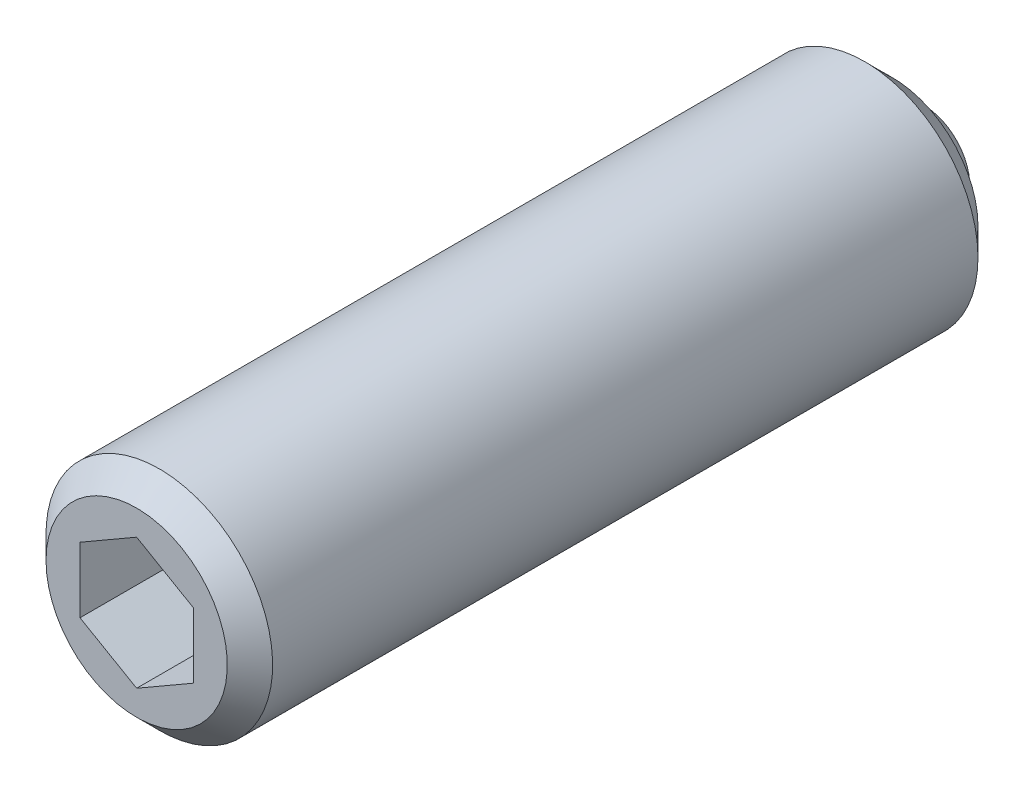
ISO-10303-21;
HEADER;
FILE_DESCRIPTION(('STEP AP214'),'2;1');
FILE_NAME('part.step','',(''),(''),'','','');
FILE_SCHEMA(('AUTOMOTIVE_DESIGN { 1 0 10303 214 1 1 1 1 }'));
ENDSEC;
DATA;
#1=APPLICATION_CONTEXT('core data for automotive mechanical design processes');
#2=APPLICATION_PROTOCOL_DEFINITION('international standard','automotive_design',2000,#1);
#3=PRODUCT_CONTEXT('',#1,'mechanical');
#4=PRODUCT('Part','Part','',(#3));
#5=PRODUCT_RELATED_PRODUCT_CATEGORY('part','',(#4));
#6=PRODUCT_DEFINITION_FORMATION('','',#4);
#7=PRODUCT_DEFINITION_CONTEXT('part definition',#1,'design');
#8=PRODUCT_DEFINITION('design','',#6,#7);
#9=PRODUCT_DEFINITION_SHAPE('','',#8);
#10=(LENGTH_UNIT() NAMED_UNIT(*) SI_UNIT(.MILLI.,.METRE.));
#11=(NAMED_UNIT(*) PLANE_ANGLE_UNIT() SI_UNIT($,.RADIAN.));
#12=(NAMED_UNIT(*) SI_UNIT($,.STERADIAN.) SOLID_ANGLE_UNIT());
#13=UNCERTAINTY_MEASURE_WITH_UNIT(LENGTH_MEASURE(1.E-05),#10,'distance_accuracy_value','');
#14=(GEOMETRIC_REPRESENTATION_CONTEXT(3) GLOBAL_UNCERTAINTY_ASSIGNED_CONTEXT((#13)) GLOBAL_UNIT_ASSIGNED_CONTEXT((#10,
#11,#12)) REPRESENTATION_CONTEXT('',''));
#15=CARTESIAN_POINT('',(0.,0.,0.));
#16=DIRECTION('',(0.,0.,1.));
#17=DIRECTION('',(1.,0.,0.));
#18=AXIS2_PLACEMENT_3D('',#15,#16,#17);
#19=CARTESIAN_POINT('',(-7.77251369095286E-10,1.26264430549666E-13,17.95));
#20=DIRECTION('',(-4.33009119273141E-11,0.,1.));
#21=DIRECTION('',(-0.499999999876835,0.866025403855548,-2.16565477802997E-11));
#22=AXIS2_PLACEMENT_3D('',#19,#20,#21);
#23=CYLINDRICAL_SURFACE('',#22,6.);
#24=CARTESIAN_POINT('',(-1.78832766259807E-09,2.90513703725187E-13,41.3));
#25=DIRECTION('',(-4.33009119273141E-11,0.,1.));
#26=DIRECTION('',(-0.499999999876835,0.866025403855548,-2.16565839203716E-11));
#27=AXIS2_PLACEMENT_3D('',#24,#25,#26);
#28=CIRCLE('',#27,6.);
#29=CARTESIAN_POINT('',(-3.00000000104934,5.19615242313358,41.2999999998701));
#30=VERTEX_POINT('',#29);
#31=EDGE_CURVE('E112',#30,#30,#28,.T.);
#32=ORIENTED_EDGE('',*,*,#31,.F.);
#33=EDGE_LOOP('',(#32));
#34=FACE_BOUND('',#33,.T.);
#35=CARTESIAN_POINT('',(-1.71038602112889E-10,0.,3.95));
#36=DIRECTION('',(-4.33009119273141E-11,0.,1.));
#37=DIRECTION('',(-0.866025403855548,-0.499999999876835,-3.74846078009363E-11));
#38=AXIS2_PLACEMENT_3D('',#35,#36,#37);
#39=CIRCLE('',#38,6.);
#40=CARTESIAN_POINT('',(-5.19615242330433,-2.99999999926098,3.94999999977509));
#41=VERTEX_POINT('',#40);
#42=EDGE_CURVE('E120',#41,#41,#39,.T.);
#43=ORIENTED_EDGE('',*,*,#42,.T.);
#44=EDGE_LOOP('',(#43));
#45=FACE_BOUND('',#44,.T.);
#46=ADVANCED_FACE('F14',(#34,#45),#23,.T.);
#47=CARTESIAN_POINT('',(1.49999999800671,4.33012701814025,37.5000000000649));
#48=DIRECTION('',(4.33009119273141E-11,0.,-1.));
#49=DIRECTION('',(0.499999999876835,-0.866025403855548,2.16565477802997E-11));
#50=AXIS2_PLACEMENT_3D('',#47,#48,#49);
#51=PLANE('',#50);
#52=DIRECTION('',(0.866025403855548,0.499999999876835,3.74961726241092E-11));
#53=VECTOR('',#52,1.);
#54=CARTESIAN_POINT('',(1.49999999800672,-2.59807621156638,37.500000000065));
#55=LINE('',#54,#53);
#56=CARTESIAN_POINT('',(-2.48980827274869E-09,-3.46410161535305,37.5));
#57=VERTEX_POINT('',#56);
#58=CARTESIAN_POINT('',(2.99999999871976,-1.73205080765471,37.5000000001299));
#59=VERTEX_POINT('',#58);
#60=EDGE_CURVE('E106',#57,#59,#55,.T.);
#61=ORIENTED_EDGE('',*,*,#60,.T.);
#62=DIRECTION('',(0.,1.,0.));
#63=VECTOR('',#62,1.);
#64=CARTESIAN_POINT('',(2.99999999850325,-3.53051138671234E-10,37.5000000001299));
#65=LINE('',#64,#63);
#66=CARTESIAN_POINT('',(2.99999999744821,1.73205080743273,37.5000000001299));
#67=VERTEX_POINT('',#66);
#68=EDGE_CURVE('E104',#59,#67,#65,.T.);
#69=ORIENTED_EDGE('',*,*,#68,.T.);
#70=DIRECTION('',(-0.866025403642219,0.500000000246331,-3.75032068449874E-11));
#71=VECTOR('',#70,1.);
#72=CARTESIAN_POINT('',(1.49999999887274,2.5980762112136,37.5000000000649));
#73=LINE('',#72,#71);
#74=CARTESIAN_POINT('',(-7.57762125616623E-10,3.46410161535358,37.5));
#75=VERTEX_POINT('',#74);
#76=EDGE_CURVE('E101',#67,#75,#73,.T.);
#77=ORIENTED_EDGE('',*,*,#76,.T.);
#78=DIRECTION('',(-0.866025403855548,-0.499999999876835,-3.74961726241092E-11));
#79=VECTOR('',#78,1.);
#80=CARTESIAN_POINT('',(-1.50000000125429,2.59807621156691,37.499999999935));
#81=LINE('',#80,#79);
#82=CARTESIAN_POINT('',(-3.00000000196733,1.73205080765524,37.4999999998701));
#83=VERTEX_POINT('',#82);
#84=EDGE_CURVE('E45',#75,#83,#81,.T.);
#85=ORIENTED_EDGE('',*,*,#84,.T.);
#86=DIRECTION('',(0.,-1.,0.));
#87=VECTOR('',#86,1.);
#88=CARTESIAN_POINT('',(-3.00000000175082,3.5357697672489E-10,37.4999999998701));
#89=LINE('',#88,#87);
#90=CARTESIAN_POINT('',(-3.0000000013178,-1.73205080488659,37.4999999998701));
#91=VERTEX_POINT('',#90);
#92=EDGE_CURVE('E82',#83,#91,#89,.T.);
#93=ORIENTED_EDGE('',*,*,#92,.T.);
#94=DIRECTION('',(0.866025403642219,-0.500000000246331,3.75032068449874E-11));
#95=VECTOR('',#94,1.);
#96=CARTESIAN_POINT('',(-1.50000000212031,-2.59807621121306,37.4999999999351));
#97=LINE('',#96,#95);
#98=EDGE_CURVE('E9',#91,#57,#97,.T.);
#99=ORIENTED_EDGE('',*,*,#98,.T.);
#100=EDGE_LOOP('',(#61,#69,#77,#85,#93,#99));
#101=FACE_BOUND('',#100,.T.);
#102=ADVANCED_FACE('F138',(#101),#51,.F.);
#103=CARTESIAN_POINT('',(-2.70631282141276E-09,-3.46410161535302,42.5));
#104=DIRECTION('',(-0.500000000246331,-0.866025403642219,-2.16443641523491E-11));
#105=DIRECTION('',(-0.866025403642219,0.500000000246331,-3.75032068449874E-11));
#106=AXIS2_PLACEMENT_3D('',#103,#104,#105);
#107=PLANE('',#106);
#108=ORIENTED_EDGE('',*,*,#98,.F.);
#109=DIRECTION('',(-4.33009119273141E-11,0.,1.));
#110=VECTOR('',#109,1.);
#111=CARTESIAN_POINT('',(-3.00000000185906,-1.73205080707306,39.9999999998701));
#112=LINE('',#111,#110);
#113=CARTESIAN_POINT('',(-3.00000000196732,-1.73205080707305,42.4999999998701));
#114=VERTEX_POINT('',#113);
#115=EDGE_CURVE('E111',#91,#114,#112,.T.);
#116=ORIENTED_EDGE('',*,*,#115,.T.);
#117=DIRECTION('',(-0.866025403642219,0.500000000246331,-3.75032068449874E-11));
#118=VECTOR('',#117,1.);
#119=CARTESIAN_POINT('',(-2.70631282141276E-09,-3.46410161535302,42.5));
#120=LINE('',#119,#118);
#121=CARTESIAN_POINT('',(-4.98947259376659E-09,-3.46410161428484,42.5));
#122=VERTEX_POINT('',#121);
#123=EDGE_CURVE('E59',#114,#122,#120,.F.);
#124=ORIENTED_EDGE('',*,*,#123,.T.);
#125=DIRECTION('',(4.33009119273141E-11,0.,-1.));
#126=VECTOR('',#125,1.);
#127=CARTESIAN_POINT('',(-3.4640838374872E-09,-3.46410161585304,40.));
#128=LINE('',#127,#126);
#129=EDGE_CURVE('E23',#122,#57,#128,.T.);
#130=ORIENTED_EDGE('',*,*,#129,.T.);
#131=EDGE_LOOP('',(#108,#116,#124,#130));
#132=FACE_BOUND('',#131,.T.);
#133=ADVANCED_FACE('F137',(#132),#107,.F.);
#134=CARTESIAN_POINT('',(2.99999999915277,-1.73205080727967,42.5000000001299));
#135=DIRECTION('',(0.499999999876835,-0.866025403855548,2.16565477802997E-11));
#136=DIRECTION('',(-0.866025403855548,-0.499999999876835,-3.74961726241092E-11));
#137=AXIS2_PLACEMENT_3D('',#134,#135,#136);
#138=PLANE('',#137);
#139=ORIENTED_EDGE('',*,*,#60,.F.);
#140=ORIENTED_EDGE('',*,*,#129,.F.);
#141=DIRECTION('',(0.866025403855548,0.499999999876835,3.74961726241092E-11));
#142=VECTOR('',#141,1.);
#143=CARTESIAN_POINT('',(1.49999999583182,-2.59807620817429,42.500000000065));
#144=LINE('',#143,#142);
#145=CARTESIAN_POINT('',(2.99999999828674,-1.73205080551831,42.5000000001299));
#146=VERTEX_POINT('',#145);
#147=EDGE_CURVE('E128',#122,#146,#144,.T.);
#148=ORIENTED_EDGE('',*,*,#147,.T.);
#149=DIRECTION('',(4.33009119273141E-11,0.,-1.));
#150=VECTOR('',#149,1.);
#151=CARTESIAN_POINT('',(2.999999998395,-1.73205080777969,40.0000000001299));
#152=LINE('',#151,#150);
#153=EDGE_CURVE('E98',#146,#59,#152,.T.);
#154=ORIENTED_EDGE('',*,*,#153,.T.);
#155=EDGE_LOOP('',(#139,#140,#148,#154));
#156=FACE_BOUND('',#155,.T.);
#157=ADVANCED_FACE('F135',(#156),#138,.F.);
#158=CARTESIAN_POINT('',(2.99999999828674,1.73205080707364,42.5000000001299));
#159=DIRECTION('',(1.,0.,4.3300911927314E-11));
#160=DIRECTION('',(0.,-1.,0.));
#161=AXIS2_PLACEMENT_3D('',#158,#159,#160);
#162=PLANE('',#161);
#163=ORIENTED_EDGE('',*,*,#68,.F.);
#164=ORIENTED_EDGE('',*,*,#153,.F.);
#165=DIRECTION('',(0.,-1.,0.));
#166=VECTOR('',#165,1.);
#167=CARTESIAN_POINT('',(2.99999999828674,1.73205080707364,42.5000000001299));
#168=LINE('',#167,#166);
#169=CARTESIAN_POINT('',(2.99999999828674,1.73205080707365,42.5000000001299));
#170=VERTEX_POINT('',#169);
#171=EDGE_CURVE('E94',#146,#170,#168,.F.);
#172=ORIENTED_EDGE('',*,*,#171,.T.);
#173=DIRECTION('',(4.33009119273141E-11,0.,-1.));
#174=VECTOR('',#173,1.);
#175=CARTESIAN_POINT('',(2.999999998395,1.73205080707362,40.0000000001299));
#176=LINE('',#175,#174);
#177=EDGE_CURVE('E102',#170,#67,#176,.T.);
#178=ORIENTED_EDGE('',*,*,#177,.T.);
#179=EDGE_LOOP('',(#163,#164,#172,#178));
#180=FACE_BOUND('',#179,.T.);
#181=ADVANCED_FACE('F175',(#180),#162,.F.);
#182=CARTESIAN_POINT('',(-9.74266674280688E-10,3.46410161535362,42.5));
#183=DIRECTION('',(0.500000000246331,0.866025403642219,2.16443641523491E-11));
#184=DIRECTION('',(0.866025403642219,-0.500000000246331,3.75032068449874E-11));
#185=AXIS2_PLACEMENT_3D('',#182,#183,#184);
#186=PLANE('',#185);
#187=ORIENTED_EDGE('',*,*,#76,.F.);
#188=ORIENTED_EDGE('',*,*,#177,.F.);
#189=DIRECTION('',(0.866025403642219,-0.500000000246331,3.75032068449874E-11));
#190=VECTOR('',#189,1.);
#191=CARTESIAN_POINT('',(-9.74266674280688E-10,3.46410161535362,42.5));
#192=LINE('',#191,#190);
#193=CARTESIAN_POINT('',(1.30889570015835E-09,3.46410161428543,42.5));
#194=VERTEX_POINT('',#193);
#195=EDGE_CURVE('E92',#170,#194,#192,.F.);
#196=ORIENTED_EDGE('',*,*,#195,.T.);
#197=DIRECTION('',(4.33009119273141E-11,0.,-1.));
#198=VECTOR('',#197,1.);
#199=CARTESIAN_POINT('',(0.,3.4641016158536,40.));
#200=LINE('',#199,#198);
#201=EDGE_CURVE('E73',#194,#75,#200,.T.);
#202=ORIENTED_EDGE('',*,*,#201,.T.);
#203=EDGE_LOOP('',(#187,#188,#196,#202));
#204=FACE_BOUND('',#203,.T.);
#205=ADVANCED_FACE('F172',(#204),#186,.F.);
#206=CARTESIAN_POINT('',(-3.00000000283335,1.73205080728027,42.4999999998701));
#207=DIRECTION('',(-0.499999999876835,0.866025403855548,-2.16565477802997E-11));
#208=DIRECTION('',(0.866025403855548,0.499999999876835,3.74961726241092E-11));
#209=AXIS2_PLACEMENT_3D('',#206,#207,#208);
#210=PLANE('',#209);
#211=ORIENTED_EDGE('',*,*,#84,.F.);
#212=ORIENTED_EDGE('',*,*,#201,.F.);
#213=DIRECTION('',(-0.866025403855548,-0.499999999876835,-3.74961726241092E-11));
#214=VECTOR('',#213,1.);
#215=CARTESIAN_POINT('',(-1.49999999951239,2.59807620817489,42.499999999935));
#216=LINE('',#215,#214);
#217=CARTESIAN_POINT('',(-3.00000000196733,1.73205080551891,42.4999999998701));
#218=VERTEX_POINT('',#217);
#219=EDGE_CURVE('E87',#194,#218,#216,.T.);
#220=ORIENTED_EDGE('',*,*,#219,.T.);
#221=DIRECTION('',(4.33009119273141E-11,0.,-1.));
#222=VECTOR('',#221,1.);
#223=CARTESIAN_POINT('',(-3.00000000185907,1.73205080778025,39.9999999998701));
#224=LINE('',#223,#222);
#225=EDGE_CURVE('E79',#218,#83,#224,.T.);
#226=ORIENTED_EDGE('',*,*,#225,.T.);
#227=EDGE_LOOP('',(#211,#212,#220,#226));
#228=FACE_BOUND('',#227,.T.);
#229=ADVANCED_FACE('F91',(#228),#210,.F.);
#230=CARTESIAN_POINT('',(-3.00000000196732,-1.73205080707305,42.4999999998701));
#231=DIRECTION('',(-1.,0.,-4.3300911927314E-11));
#232=DIRECTION('',(0.,1.,0.));
#233=AXIS2_PLACEMENT_3D('',#230,#231,#232);
#234=PLANE('',#233);
#235=ORIENTED_EDGE('',*,*,#92,.F.);
#236=ORIENTED_EDGE('',*,*,#225,.F.);
#237=DIRECTION('',(0.,1.,0.));
#238=VECTOR('',#237,1.);
#239=CARTESIAN_POINT('',(-3.00000000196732,-1.73205080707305,42.4999999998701));
#240=LINE('',#239,#238);
#241=EDGE_CURVE('E81',#218,#114,#240,.F.);
#242=ORIENTED_EDGE('',*,*,#241,.T.);
#243=ORIENTED_EDGE('',*,*,#115,.F.);
#244=EDGE_LOOP('',(#235,#236,#242,#243));
#245=FACE_BOUND('',#244,.T.);
#246=ADVANCED_FACE('F80',(#245),#234,.F.);
#247=CARTESIAN_POINT('',(1.7780050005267,6.63560500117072,42.5000000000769));
#248=DIRECTION('',(4.33009119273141E-11,0.,-1.));
#249=DIRECTION('',(0.499999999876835,-0.866025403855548,2.16565477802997E-11));
#250=AXIS2_PLACEMENT_3D('',#247,#248,#249);
#251=PLANE('',#250);
#252=ORIENTED_EDGE('',*,*,#219,.F.);
#253=ORIENTED_EDGE('',*,*,#195,.F.);
#254=ORIENTED_EDGE('',*,*,#171,.F.);
#255=ORIENTED_EDGE('',*,*,#147,.F.);
#256=ORIENTED_EDGE('',*,*,#123,.F.);
#257=ORIENTED_EDGE('',*,*,#241,.F.);
#258=EDGE_LOOP('',(#252,#253,#254,#255,#256,#257));
#259=FACE_BOUND('',#258,.T.);
#260=CARTESIAN_POINT('',(-1.84028875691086E-09,2.98954779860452E-13,42.5));
#261=DIRECTION('',(4.33009119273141E-11,0.,-1.));
#262=DIRECTION('',(0.499999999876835,-0.866025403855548,2.16565477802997E-11));
#263=AXIS2_PLACEMENT_3D('',#260,#261,#262);
#264=CIRCLE('',#263,4.8);
#265=CARTESIAN_POINT('',(2.39999999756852,-4.15692193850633,42.500000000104));
#266=VERTEX_POINT('',#265);
#267=EDGE_CURVE('E89',#266,#266,#264,.F.);
#268=ORIENTED_EDGE('',*,*,#267,.T.);
#269=EDGE_LOOP('',(#268));
#270=FACE_BOUND('',#269,.T.);
#271=ADVANCED_FACE('F84',(#259,#270),#251,.F.);
#272=CARTESIAN_POINT('',(-1.84028875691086E-09,2.98954779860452E-13,42.5));
#273=DIRECTION('',(4.33009119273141E-11,0.,-1.));
#274=DIRECTION('',(0.499999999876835,-0.866025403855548,2.16565477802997E-11));
#275=AXIS2_PLACEMENT_3D('',#272,#273,#274);
#276=CONICAL_SURFACE('',#275,4.8,0.785398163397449);
#277=ORIENTED_EDGE('',*,*,#267,.F.);
#278=EDGE_LOOP('',(#277));
#279=FACE_BOUND('',#278,.T.);
#280=ORIENTED_EDGE('',*,*,#31,.T.);
#281=EDGE_LOOP('',(#280));
#282=FACE_BOUND('',#281,.T.);
#283=ADVANCED_FACE('F150',(#279,#282),#276,.T.);
#284=CARTESIAN_POINT('',(6.29000057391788,-1.68540057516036,2.50000000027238));
#285=DIRECTION('',(-4.33009119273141E-11,0.,1.));
#286=DIRECTION('',(-0.499999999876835,0.866025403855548,-2.16565477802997E-11));
#287=AXIS2_PLACEMENT_3D('',#284,#285,#286);
#288=PLANE('',#287);
#289=CARTESIAN_POINT('',(6.49522318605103E-11,0.,2.5));
#290=DIRECTION('',(-4.33009119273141E-11,0.,1.));
#291=DIRECTION('',(1.,0.,4.33009119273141E-11));
#292=AXIS2_PLACEMENT_3D('',#289,#290,#291);
#293=CIRCLE('',#292,3.70809924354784);
#294=CARTESIAN_POINT('',(3.70809924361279,0.,2.50000000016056));
#295=VERTEX_POINT('',#294);
#296=EDGE_CURVE('E17',#295,#295,#293,.T.);
#297=ORIENTED_EDGE('',*,*,#296,.T.);
#298=EDGE_LOOP('',(#297));
#299=FACE_BOUND('',#298,.T.);
#300=CARTESIAN_POINT('',(-1.08252279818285E-10,0.,2.5));
#301=DIRECTION('',(-4.33011025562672E-11,0.,1.));
#302=DIRECTION('',(-0.499999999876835,0.866025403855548,-2.16569290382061E-11));
#303=AXIS2_PLACEMENT_3D('',#300,#301,#302);
#304=CIRCLE('',#303,4.55);
#305=CARTESIAN_POINT('',(-2.27499999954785,3.94041558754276,2.49999999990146));
#306=VERTEX_POINT('',#305);
#307=EDGE_CURVE('E114',#306,#306,#304,.T.);
#308=ORIENTED_EDGE('',*,*,#307,.F.);
#309=EDGE_LOOP('',(#308));
#310=FACE_BOUND('',#309,.T.);
#311=ADVANCED_FACE('F153',(#299,#310),#288,.F.);
#312=CARTESIAN_POINT('',(-1.08252279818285E-10,0.,2.5));
#313=DIRECTION('',(-4.33011025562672E-11,0.,1.));
#314=DIRECTION('',(-0.499999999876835,0.866025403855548,-2.16569290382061E-11));
#315=AXIS2_PLACEMENT_3D('',#312,#313,#314);
#316=CONICAL_SURFACE('',#315,4.55,0.785398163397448);
#317=ORIENTED_EDGE('',*,*,#42,.F.);
#318=EDGE_LOOP('',(#317));
#319=FACE_BOUND('',#318,.T.);
#320=ORIENTED_EDGE('',*,*,#307,.T.);
#321=EDGE_LOOP('',(#320));
#322=FACE_BOUND('',#321,.T.);
#323=ADVANCED_FACE('F142',(#319,#322),#316,.T.);
#324=CARTESIAN_POINT('',(0.,0.,4.));
#325=DIRECTION('',(0.,0.,-1.));
#326=DIRECTION('',(-1.,0.,0.));
#327=AXIS2_PLACEMENT_3D('',#324,#325,#326);
#328=SPHERICAL_SURFACE('',#327,4.);
#329=ORIENTED_EDGE('',*,*,#296,.F.);
#330=EDGE_LOOP('',(#329));
#331=FACE_BOUND('',#330,.T.);
#332=ADVANCED_FACE('F152',(#331),#328,.T.);
#333=CLOSED_SHELL('',(#46,#102,#133,#157,#181,#205,#229,#246,#271,#283,#311,#323,#332));
#334=MANIFOLD_SOLID_BREP('B1',#333);
#335=ADVANCED_BREP_SHAPE_REPRESENTATION('',(#18,#334),#14);
#336=SHAPE_DEFINITION_REPRESENTATION(#9,#335);
ENDSEC;
END-ISO-10303-21;
